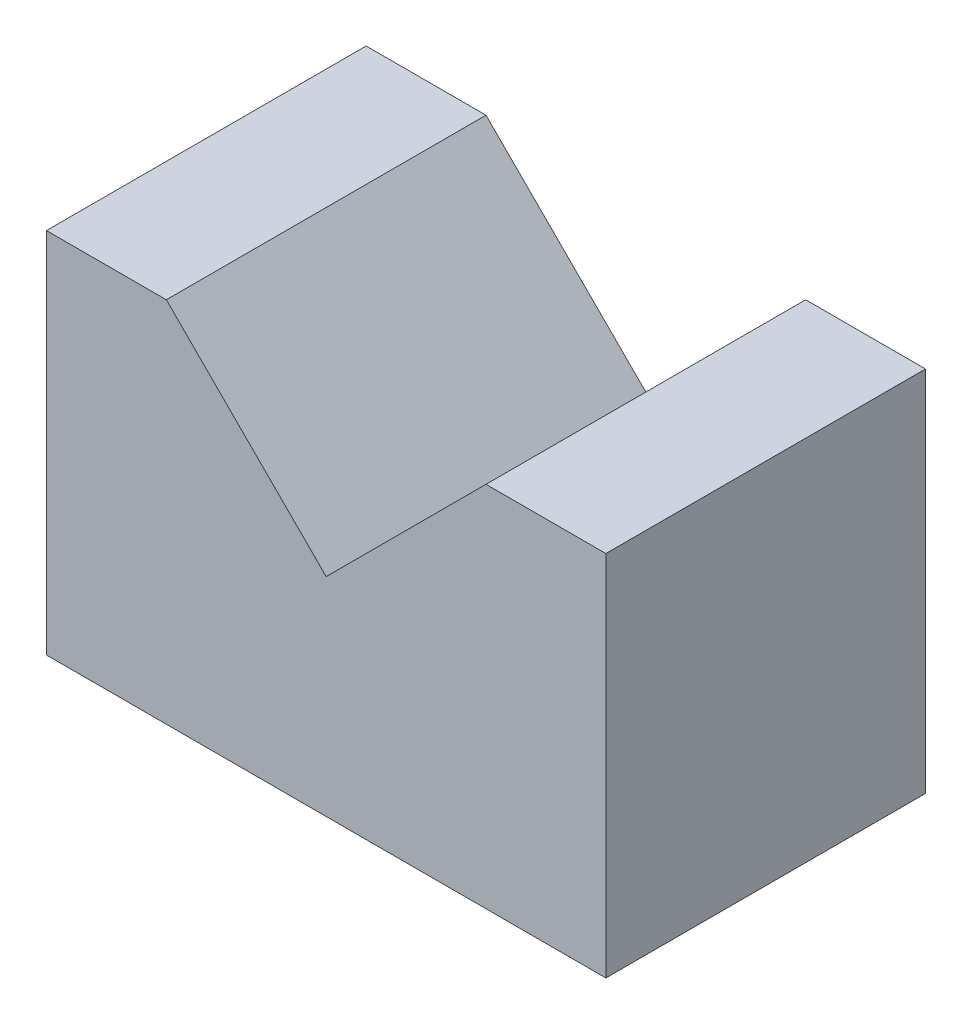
ISO-10303-21;
HEADER;
FILE_DESCRIPTION(('STEP AP214'),'2;1');
FILE_NAME('part.step','',(''),(''),'','','');
FILE_SCHEMA(('AUTOMOTIVE_DESIGN { 1 0 10303 214 1 1 1 1 }'));
ENDSEC;
DATA;
#1=APPLICATION_CONTEXT('core data for automotive mechanical design processes');
#2=APPLICATION_PROTOCOL_DEFINITION('international standard','automotive_design',2000,#1);
#3=PRODUCT_CONTEXT('',#1,'mechanical');
#4=PRODUCT('Part','Part','',(#3));
#5=PRODUCT_RELATED_PRODUCT_CATEGORY('part','',(#4));
#6=PRODUCT_DEFINITION_FORMATION('','',#4);
#7=PRODUCT_DEFINITION_CONTEXT('part definition',#1,'design');
#8=PRODUCT_DEFINITION('design','',#6,#7);
#9=PRODUCT_DEFINITION_SHAPE('','',#8);
#10=(LENGTH_UNIT() NAMED_UNIT(*) SI_UNIT(.MILLI.,.METRE.));
#11=(NAMED_UNIT(*) PLANE_ANGLE_UNIT() SI_UNIT($,.RADIAN.));
#12=(NAMED_UNIT(*) SI_UNIT($,.STERADIAN.) SOLID_ANGLE_UNIT());
#13=UNCERTAINTY_MEASURE_WITH_UNIT(LENGTH_MEASURE(1.E-05),#10,'distance_accuracy_value','');
#14=(GEOMETRIC_REPRESENTATION_CONTEXT(3) GLOBAL_UNCERTAINTY_ASSIGNED_CONTEXT((#13)) GLOBAL_UNIT_ASSIGNED_CONTEXT((#10,
#11,#12)) REPRESENTATION_CONTEXT('',''));
#15=CARTESIAN_POINT('',(0.,0.,0.));
#16=DIRECTION('',(0.,0.,1.));
#17=DIRECTION('',(1.,0.,0.));
#18=AXIS2_PLACEMENT_3D('',#15,#16,#17);
#19=CARTESIAN_POINT('',(70.,0.,40.));
#20=DIRECTION('',(0.,1.,0.));
#21=DIRECTION('',(-1.,0.,0.));
#22=AXIS2_PLACEMENT_3D('',#19,#20,#21);
#23=PLANE('',#22);
#24=DIRECTION('',(1.,0.,0.));
#25=VECTOR('',#24,1.);
#26=CARTESIAN_POINT('',(70.,0.,0.));
#27=LINE('',#26,#25);
#28=CARTESIAN_POINT('',(0.,0.,0.));
#29=VERTEX_POINT('',#28);
#30=CARTESIAN_POINT('',(70.,0.,0.));
#31=VERTEX_POINT('',#30);
#32=EDGE_CURVE('E121',#29,#31,#27,.T.);
#33=ORIENTED_EDGE('',*,*,#32,.T.);
#34=DIRECTION('',(0.,0.,-1.));
#35=VECTOR('',#34,1.);
#36=CARTESIAN_POINT('',(70.,0.,40.));
#37=LINE('',#36,#35);
#38=CARTESIAN_POINT('',(70.,0.,40.));
#39=VERTEX_POINT('',#38);
#40=EDGE_CURVE('E11',#39,#31,#37,.T.);
#41=ORIENTED_EDGE('',*,*,#40,.F.);
#42=DIRECTION('',(1.,0.,0.));
#43=VECTOR('',#42,1.);
#44=CARTESIAN_POINT('',(70.,0.,40.));
#45=LINE('',#44,#43);
#46=CARTESIAN_POINT('',(0.,0.,40.));
#47=VERTEX_POINT('',#46);
#48=EDGE_CURVE('E133',#47,#39,#45,.T.);
#49=ORIENTED_EDGE('',*,*,#48,.F.);
#50=DIRECTION('',(0.,0.,-1.));
#51=VECTOR('',#50,1.);
#52=CARTESIAN_POINT('',(0.,0.,40.));
#53=LINE('',#52,#51);
#54=EDGE_CURVE('E117',#47,#29,#53,.T.);
#55=ORIENTED_EDGE('',*,*,#54,.T.);
#56=EDGE_LOOP('',(#33,#41,#49,#55));
#57=FACE_BOUND('',#56,.T.);
#58=ADVANCED_FACE('F31',(#57),#23,.F.);
#59=CARTESIAN_POINT('',(70.,46.,40.));
#60=DIRECTION('',(-1.,0.,0.));
#61=DIRECTION('',(0.,0.,1.));
#62=AXIS2_PLACEMENT_3D('',#59,#60,#61);
#63=PLANE('',#62);
#64=DIRECTION('',(0.,1.,0.));
#65=VECTOR('',#64,1.);
#66=CARTESIAN_POINT('',(70.,46.,0.));
#67=LINE('',#66,#65);
#68=CARTESIAN_POINT('',(70.,46.,0.));
#69=VERTEX_POINT('',#68);
#70=EDGE_CURVE('E124',#31,#69,#67,.T.);
#71=ORIENTED_EDGE('',*,*,#70,.T.);
#72=DIRECTION('',(0.,0.,-1.));
#73=VECTOR('',#72,1.);
#74=CARTESIAN_POINT('',(70.,46.,40.));
#75=LINE('',#74,#73);
#76=CARTESIAN_POINT('',(70.,46.,40.));
#77=VERTEX_POINT('',#76);
#78=EDGE_CURVE('E39',#77,#69,#75,.T.);
#79=ORIENTED_EDGE('',*,*,#78,.F.);
#80=DIRECTION('',(0.,1.,0.));
#81=VECTOR('',#80,1.);
#82=CARTESIAN_POINT('',(70.,46.,40.));
#83=LINE('',#82,#81);
#84=EDGE_CURVE('E87',#39,#77,#83,.T.);
#85=ORIENTED_EDGE('',*,*,#84,.F.);
#86=ORIENTED_EDGE('',*,*,#40,.T.);
#87=EDGE_LOOP('',(#71,#79,#85,#86));
#88=FACE_BOUND('',#87,.T.);
#89=ADVANCED_FACE('F158',(#88),#63,.F.);
#90=CARTESIAN_POINT('',(55.,46.,40.));
#91=DIRECTION('',(0.,-1.,0.));
#92=DIRECTION('',(0.,0.,-1.));
#93=AXIS2_PLACEMENT_3D('',#90,#91,#92);
#94=PLANE('',#93);
#95=DIRECTION('',(-1.,0.,0.));
#96=VECTOR('',#95,1.);
#97=CARTESIAN_POINT('',(55.,46.,0.));
#98=LINE('',#97,#96);
#99=CARTESIAN_POINT('',(55.,46.,0.));
#100=VERTEX_POINT('',#99);
#101=EDGE_CURVE('E126',#69,#100,#98,.T.);
#102=ORIENTED_EDGE('',*,*,#101,.T.);
#103=DIRECTION('',(0.,0.,-1.));
#104=VECTOR('',#103,1.);
#105=CARTESIAN_POINT('',(55.,46.,40.));
#106=LINE('',#105,#104);
#107=CARTESIAN_POINT('',(55.,46.,40.));
#108=VERTEX_POINT('',#107);
#109=EDGE_CURVE('E137',#108,#100,#106,.T.);
#110=ORIENTED_EDGE('',*,*,#109,.F.);
#111=DIRECTION('',(-1.,0.,0.));
#112=VECTOR('',#111,1.);
#113=CARTESIAN_POINT('',(55.,46.,40.));
#114=LINE('',#113,#112);
#115=EDGE_CURVE('E145',#77,#108,#114,.T.);
#116=ORIENTED_EDGE('',*,*,#115,.F.);
#117=ORIENTED_EDGE('',*,*,#78,.T.);
#118=EDGE_LOOP('',(#102,#110,#116,#117));
#119=FACE_BOUND('',#118,.T.);
#120=ADVANCED_FACE('F143',(#119),#94,.F.);
#121=CARTESIAN_POINT('',(34.9999970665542,26.,40.));
#122=DIRECTION('',(0.707106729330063,-0.707106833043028,0.));
#123=DIRECTION('',(0.707106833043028,0.707106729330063,0.));
#124=AXIS2_PLACEMENT_3D('',#121,#122,#123);
#125=PLANE('',#124);
#126=DIRECTION('',(-0.707106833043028,-0.707106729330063,0.));
#127=VECTOR('',#126,1.);
#128=CARTESIAN_POINT('',(34.9999970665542,26.,0.));
#129=LINE('',#128,#127);
#130=CARTESIAN_POINT('',(34.9999970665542,26.,0.));
#131=VERTEX_POINT('',#130);
#132=EDGE_CURVE('E128',#100,#131,#129,.T.);
#133=ORIENTED_EDGE('',*,*,#132,.T.);
#134=DIRECTION('',(0.,0.,-1.));
#135=VECTOR('',#134,1.);
#136=CARTESIAN_POINT('',(34.9999970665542,26.,40.));
#137=LINE('',#136,#135);
#138=CARTESIAN_POINT('',(34.9999970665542,26.,40.));
#139=VERTEX_POINT('',#138);
#140=EDGE_CURVE('E112',#139,#131,#137,.T.);
#141=ORIENTED_EDGE('',*,*,#140,.F.);
#142=DIRECTION('',(-0.707106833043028,-0.707106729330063,0.));
#143=VECTOR('',#142,1.);
#144=CARTESIAN_POINT('',(34.9999970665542,26.,40.));
#145=LINE('',#144,#143);
#146=EDGE_CURVE('E103',#108,#139,#145,.T.);
#147=ORIENTED_EDGE('',*,*,#146,.F.);
#148=ORIENTED_EDGE('',*,*,#109,.T.);
#149=EDGE_LOOP('',(#133,#141,#147,#148));
#150=FACE_BOUND('',#149,.T.);
#151=ADVANCED_FACE('F151',(#150),#125,.F.);
#152=CARTESIAN_POINT('',(15.,46.,40.));
#153=DIRECTION('',(-0.707106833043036,-0.707106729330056,0.));
#154=DIRECTION('',(0.707106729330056,-0.707106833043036,0.));
#155=AXIS2_PLACEMENT_3D('',#152,#153,#154);
#156=PLANE('',#155);
#157=DIRECTION('',(-0.707106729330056,0.707106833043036,0.));
#158=VECTOR('',#157,1.);
#159=CARTESIAN_POINT('',(15.,46.,0.));
#160=LINE('',#159,#158);
#161=CARTESIAN_POINT('',(15.,46.,0.));
#162=VERTEX_POINT('',#161);
#163=EDGE_CURVE('E111',#131,#162,#160,.T.);
#164=ORIENTED_EDGE('',*,*,#163,.T.);
#165=DIRECTION('',(0.,0.,-1.));
#166=VECTOR('',#165,1.);
#167=CARTESIAN_POINT('',(15.,46.,40.));
#168=LINE('',#167,#166);
#169=CARTESIAN_POINT('',(15.,46.,40.));
#170=VERTEX_POINT('',#169);
#171=EDGE_CURVE('E108',#170,#162,#168,.T.);
#172=ORIENTED_EDGE('',*,*,#171,.F.);
#173=DIRECTION('',(-0.707106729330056,0.707106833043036,0.));
#174=VECTOR('',#173,1.);
#175=CARTESIAN_POINT('',(15.,46.,40.));
#176=LINE('',#175,#174);
#177=EDGE_CURVE('E97',#139,#170,#176,.T.);
#178=ORIENTED_EDGE('',*,*,#177,.F.);
#179=ORIENTED_EDGE('',*,*,#140,.T.);
#180=EDGE_LOOP('',(#164,#172,#178,#179));
#181=FACE_BOUND('',#180,.T.);
#182=ADVANCED_FACE('F109',(#181),#156,.F.);
#183=CARTESIAN_POINT('',(0.,46.,40.));
#184=DIRECTION('',(0.,-1.,0.));
#185=DIRECTION('',(0.,0.,-1.));
#186=AXIS2_PLACEMENT_3D('',#183,#184,#185);
#187=PLANE('',#186);
#188=DIRECTION('',(-1.,0.,0.));
#189=VECTOR('',#188,1.);
#190=CARTESIAN_POINT('',(0.,46.,0.));
#191=LINE('',#190,#189);
#192=CARTESIAN_POINT('',(0.,46.,0.));
#193=VERTEX_POINT('',#192);
#194=EDGE_CURVE('E73',#162,#193,#191,.T.);
#195=ORIENTED_EDGE('',*,*,#194,.T.);
#196=DIRECTION('',(0.,0.,-1.));
#197=VECTOR('',#196,1.);
#198=CARTESIAN_POINT('',(0.,46.,40.));
#199=LINE('',#198,#197);
#200=CARTESIAN_POINT('',(0.,46.,40.));
#201=VERTEX_POINT('',#200);
#202=EDGE_CURVE('E113',#201,#193,#199,.T.);
#203=ORIENTED_EDGE('',*,*,#202,.F.);
#204=DIRECTION('',(-1.,0.,0.));
#205=VECTOR('',#204,1.);
#206=CARTESIAN_POINT('',(0.,46.,40.));
#207=LINE('',#206,#205);
#208=EDGE_CURVE('E101',#170,#201,#207,.T.);
#209=ORIENTED_EDGE('',*,*,#208,.F.);
#210=ORIENTED_EDGE('',*,*,#171,.T.);
#211=EDGE_LOOP('',(#195,#203,#209,#210));
#212=FACE_BOUND('',#211,.T.);
#213=ADVANCED_FACE('F115',(#212),#187,.F.);
#214=CARTESIAN_POINT('',(0.,0.,40.));
#215=DIRECTION('',(1.,0.,0.));
#216=DIRECTION('',(0.,0.,-1.));
#217=AXIS2_PLACEMENT_3D('',#214,#215,#216);
#218=PLANE('',#217);
#219=DIRECTION('',(0.,-1.,0.));
#220=VECTOR('',#219,1.);
#221=CARTESIAN_POINT('',(0.,0.,0.));
#222=LINE('',#221,#220);
#223=EDGE_CURVE('E79',#193,#29,#222,.T.);
#224=ORIENTED_EDGE('',*,*,#223,.T.);
#225=ORIENTED_EDGE('',*,*,#54,.F.);
#226=DIRECTION('',(0.,-1.,0.));
#227=VECTOR('',#226,1.);
#228=CARTESIAN_POINT('',(0.,0.,40.));
#229=LINE('',#228,#227);
#230=EDGE_CURVE('E47',#201,#47,#229,.T.);
#231=ORIENTED_EDGE('',*,*,#230,.F.);
#232=ORIENTED_EDGE('',*,*,#202,.T.);
#233=EDGE_LOOP('',(#224,#225,#231,#232));
#234=FACE_BOUND('',#233,.T.);
#235=ADVANCED_FACE('F172',(#234),#218,.F.);
#236=CARTESIAN_POINT('',(0.,0.,40.));
#237=DIRECTION('',(0.,0.,-1.));
#238=DIRECTION('',(-1.,0.,0.));
#239=AXIS2_PLACEMENT_3D('',#236,#237,#238);
#240=PLANE('',#239);
#241=ORIENTED_EDGE('',*,*,#48,.T.);
#242=ORIENTED_EDGE('',*,*,#84,.T.);
#243=ORIENTED_EDGE('',*,*,#115,.T.);
#244=ORIENTED_EDGE('',*,*,#146,.T.);
#245=ORIENTED_EDGE('',*,*,#177,.T.);
#246=ORIENTED_EDGE('',*,*,#208,.T.);
#247=ORIENTED_EDGE('',*,*,#230,.T.);
#248=EDGE_LOOP('',(#241,#242,#243,#244,#245,#246,#247));
#249=FACE_BOUND('',#248,.T.);
#250=ADVANCED_FACE('F99',(#249),#240,.F.);
#251=CARTESIAN_POINT('',(0.,0.,0.));
#252=DIRECTION('',(0.,0.,-1.));
#253=DIRECTION('',(-1.,0.,0.));
#254=AXIS2_PLACEMENT_3D('',#251,#252,#253);
#255=PLANE('',#254);
#256=ORIENTED_EDGE('',*,*,#32,.F.);
#257=ORIENTED_EDGE('',*,*,#223,.F.);
#258=ORIENTED_EDGE('',*,*,#194,.F.);
#259=ORIENTED_EDGE('',*,*,#163,.F.);
#260=ORIENTED_EDGE('',*,*,#132,.F.);
#261=ORIENTED_EDGE('',*,*,#101,.F.);
#262=ORIENTED_EDGE('',*,*,#70,.F.);
#263=EDGE_LOOP('',(#256,#257,#258,#259,#260,#261,#262));
#264=FACE_BOUND('',#263,.T.);
#265=ADVANCED_FACE('F149',(#264),#255,.T.);
#266=CLOSED_SHELL('',(#58,#89,#120,#151,#182,#213,#235,#250,#265));
#267=MANIFOLD_SOLID_BREP('B2',#266);
#268=ADVANCED_BREP_SHAPE_REPRESENTATION('',(#18,#267),#14);
#269=SHAPE_DEFINITION_REPRESENTATION(#9,#268);
ENDSEC;
END-ISO-10303-21;
